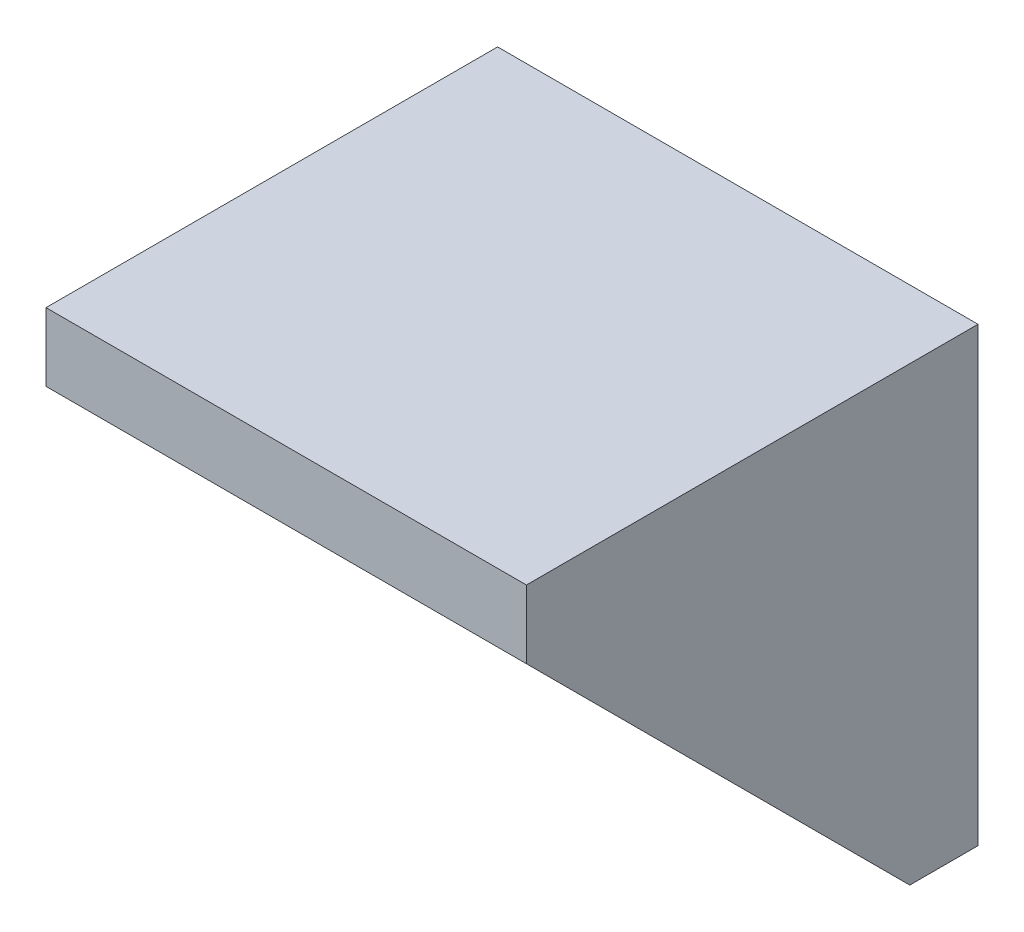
ISO-10303-21;
HEADER;
FILE_DESCRIPTION(('STEP AP214'),'2;1');
FILE_NAME('part.step','',(''),(''),'','','');
FILE_SCHEMA(('AUTOMOTIVE_DESIGN { 1 0 10303 214 1 1 1 1 }'));
ENDSEC;
DATA;
#1=APPLICATION_CONTEXT('core data for automotive mechanical design processes');
#2=APPLICATION_PROTOCOL_DEFINITION('international standard','automotive_design',2000,#1);
#3=PRODUCT_CONTEXT('',#1,'mechanical');
#4=PRODUCT('Part','Part','',(#3));
#5=PRODUCT_RELATED_PRODUCT_CATEGORY('part','',(#4));
#6=PRODUCT_DEFINITION_FORMATION('','',#4);
#7=PRODUCT_DEFINITION_CONTEXT('part definition',#1,'design');
#8=PRODUCT_DEFINITION('design','',#6,#7);
#9=PRODUCT_DEFINITION_SHAPE('','',#8);
#10=(LENGTH_UNIT() NAMED_UNIT(*) SI_UNIT(.MILLI.,.METRE.));
#11=(NAMED_UNIT(*) PLANE_ANGLE_UNIT() SI_UNIT($,.RADIAN.));
#12=(NAMED_UNIT(*) SI_UNIT($,.STERADIAN.) SOLID_ANGLE_UNIT());
#13=UNCERTAINTY_MEASURE_WITH_UNIT(LENGTH_MEASURE(1.E-05),#10,'distance_accuracy_value','');
#14=(GEOMETRIC_REPRESENTATION_CONTEXT(3) GLOBAL_UNCERTAINTY_ASSIGNED_CONTEXT((#13)) GLOBAL_UNIT_ASSIGNED_CONTEXT((#10,
#11,#12)) REPRESENTATION_CONTEXT('',''));
#15=CARTESIAN_POINT('',(0.,0.,0.));
#16=DIRECTION('',(0.,0.,1.));
#17=DIRECTION('',(1.,0.,0.));
#18=AXIS2_PLACEMENT_3D('',#15,#16,#17);
#19=CARTESIAN_POINT('',(38.1,-35.814,5.4102));
#20=DIRECTION('',(0.,0.707106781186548,-0.707106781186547));
#21=DIRECTION('',(0.,0.707106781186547,0.707106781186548));
#22=AXIS2_PLACEMENT_3D('',#19,#20,#21);
#23=PLANE('',#22);
#24=DIRECTION('',(-1.,0.,0.));
#25=VECTOR('',#24,1.);
#26=CARTESIAN_POINT('',(38.1,-35.814,5.4102));
#27=LINE('',#26,#25);
#28=CARTESIAN_POINT('',(3.04800000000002,-35.814,5.4102));
#29=VERTEX_POINT('',#28);
#30=CARTESIAN_POINT('',(0.,-35.814,5.4102));
#31=VERTEX_POINT('',#30);
#32=EDGE_CURVE('E115',#29,#31,#27,.T.);
#33=ORIENTED_EDGE('',*,*,#32,.F.);
#34=DIRECTION('',(0.,0.707106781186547,0.707106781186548));
#35=VECTOR('',#34,1.);
#36=CARTESIAN_POINT('',(3.048,-35.814,5.41019999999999));
#37=LINE('',#36,#35);
#38=CARTESIAN_POINT('',(3.048,-5.4102,35.814));
#39=VERTEX_POINT('',#38);
#40=EDGE_CURVE('E11',#29,#39,#37,.T.);
#41=ORIENTED_EDGE('',*,*,#40,.T.);
#42=DIRECTION('',(-1.,0.,0.));
#43=VECTOR('',#42,1.);
#44=CARTESIAN_POINT('',(38.1,-5.4102,35.814));
#45=LINE('',#44,#43);
#46=CARTESIAN_POINT('',(0.,-5.4102,35.814));
#47=VERTEX_POINT('',#46);
#48=EDGE_CURVE('E114',#39,#47,#45,.T.);
#49=ORIENTED_EDGE('',*,*,#48,.T.);
#50=DIRECTION('',(0.,-0.707106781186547,-0.707106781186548));
#51=VECTOR('',#50,1.);
#52=CARTESIAN_POINT('',(0.,-35.814,5.4102));
#53=LINE('',#52,#51);
#54=EDGE_CURVE('E131',#47,#31,#53,.T.);
#55=ORIENTED_EDGE('',*,*,#54,.T.);
#56=EDGE_LOOP('',(#33,#41,#49,#55));
#57=FACE_BOUND('',#56,.T.);
#58=ADVANCED_FACE('F33',(#57),#23,.F.);
#59=CARTESIAN_POINT('',(38.1,0.,35.814));
#60=DIRECTION('',(0.,-1.,0.));
#61=DIRECTION('',(0.,0.,-1.));
#62=AXIS2_PLACEMENT_3D('',#59,#60,#61);
#63=PLANE('',#62);
#64=DIRECTION('',(0.,0.,1.));
#65=VECTOR('',#64,1.);
#66=CARTESIAN_POINT('',(0.,0.,35.814));
#67=LINE('',#66,#65);
#68=CARTESIAN_POINT('',(0.,0.,0.));
#69=VERTEX_POINT('',#68);
#70=CARTESIAN_POINT('',(0.,0.,35.814));
#71=VERTEX_POINT('',#70);
#72=EDGE_CURVE('E124',#69,#71,#67,.T.);
#73=ORIENTED_EDGE('',*,*,#72,.T.);
#74=DIRECTION('',(-1.,0.,0.));
#75=VECTOR('',#74,1.);
#76=CARTESIAN_POINT('',(38.1,0.,35.814));
#77=LINE('',#76,#75);
#78=CARTESIAN_POINT('',(38.1,0.,35.814));
#79=VERTEX_POINT('',#78);
#80=EDGE_CURVE('E142',#79,#71,#77,.T.);
#81=ORIENTED_EDGE('',*,*,#80,.F.);
#82=DIRECTION('',(0.,0.,1.));
#83=VECTOR('',#82,1.);
#84=CARTESIAN_POINT('',(38.1,0.,35.814));
#85=LINE('',#84,#83);
#86=CARTESIAN_POINT('',(38.1,0.,0.));
#87=VERTEX_POINT('',#86);
#88=EDGE_CURVE('E137',#87,#79,#85,.T.);
#89=ORIENTED_EDGE('',*,*,#88,.F.);
#90=DIRECTION('',(-1.,0.,0.));
#91=VECTOR('',#90,1.);
#92=CARTESIAN_POINT('',(38.1,0.,0.));
#93=LINE('',#92,#91);
#94=EDGE_CURVE('E120',#87,#69,#93,.T.);
#95=ORIENTED_EDGE('',*,*,#94,.T.);
#96=EDGE_LOOP('',(#73,#81,#89,#95));
#97=FACE_BOUND('',#96,.T.);
#98=ADVANCED_FACE('F35',(#97),#63,.F.);
#99=CARTESIAN_POINT('',(38.1,-5.4102,35.814));
#100=DIRECTION('',(0.,0.,-1.));
#101=DIRECTION('',(-1.,0.,0.));
#102=AXIS2_PLACEMENT_3D('',#99,#100,#101);
#103=PLANE('',#102);
#104=DIRECTION('',(0.,-1.,0.));
#105=VECTOR('',#104,1.);
#106=CARTESIAN_POINT('',(0.,-5.4102,35.814));
#107=LINE('',#106,#105);
#108=EDGE_CURVE('E127',#71,#47,#107,.T.);
#109=ORIENTED_EDGE('',*,*,#108,.T.);
#110=ORIENTED_EDGE('',*,*,#48,.F.);
#111=DIRECTION('',(-1.,0.,0.));
#112=VECTOR('',#111,1.);
#113=CARTESIAN_POINT('',(3.048,-5.4102,35.814));
#114=LINE('',#113,#112);
#115=CARTESIAN_POINT('',(35.052,-5.4102,35.814));
#116=VERTEX_POINT('',#115);
#117=EDGE_CURVE('E158',#116,#39,#114,.T.);
#118=ORIENTED_EDGE('',*,*,#117,.F.);
#119=CARTESIAN_POINT('',(38.1,-5.4102,35.814));
#120=VERTEX_POINT('',#119);
#121=EDGE_CURVE('E140',#120,#116,#45,.T.);
#122=ORIENTED_EDGE('',*,*,#121,.F.);
#123=DIRECTION('',(0.,-1.,0.));
#124=VECTOR('',#123,1.);
#125=CARTESIAN_POINT('',(38.1,-5.4102,35.814));
#126=LINE('',#125,#124);
#127=EDGE_CURVE('E90',#79,#120,#126,.T.);
#128=ORIENTED_EDGE('',*,*,#127,.F.);
#129=ORIENTED_EDGE('',*,*,#80,.T.);
#130=EDGE_LOOP('',(#109,#110,#118,#122,#128,#129));
#131=FACE_BOUND('',#130,.T.);
#132=ADVANCED_FACE('F144',(#131),#103,.F.);
#133=ORIENTED_EDGE('',*,*,#121,.T.);
#134=DIRECTION('',(0.,-0.707106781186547,-0.707106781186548));
#135=VECTOR('',#134,1.);
#136=CARTESIAN_POINT('',(35.052,-35.814,5.4102));
#137=LINE('',#136,#135);
#138=CARTESIAN_POINT('',(35.052,-35.814,5.4102));
#139=VERTEX_POINT('',#138);
#140=EDGE_CURVE('E41',#116,#139,#137,.T.);
#141=ORIENTED_EDGE('',*,*,#140,.T.);
#142=CARTESIAN_POINT('',(38.1,-35.814,5.4102));
#143=VERTEX_POINT('',#142);
#144=EDGE_CURVE('E108',#143,#139,#27,.T.);
#145=ORIENTED_EDGE('',*,*,#144,.F.);
#146=DIRECTION('',(0.,-0.707106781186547,-0.707106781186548));
#147=VECTOR('',#146,1.);
#148=CARTESIAN_POINT('',(38.1,-35.814,5.4102));
#149=LINE('',#148,#147);
#150=EDGE_CURVE('E97',#120,#143,#149,.T.);
#151=ORIENTED_EDGE('',*,*,#150,.F.);
#152=EDGE_LOOP('',(#133,#141,#145,#151));
#153=FACE_BOUND('',#152,.T.);
#154=ADVANCED_FACE('F109',(#153),#23,.F.);
#155=CARTESIAN_POINT('',(38.1,-35.814,0.));
#156=DIRECTION('',(0.,1.,0.));
#157=DIRECTION('',(0.,0.,1.));
#158=AXIS2_PLACEMENT_3D('',#155,#156,#157);
#159=PLANE('',#158);
#160=DIRECTION('',(0.,0.,-1.));
#161=VECTOR('',#160,1.);
#162=CARTESIAN_POINT('',(0.,-35.814,0.));
#163=LINE('',#162,#161);
#164=CARTESIAN_POINT('',(0.,-35.814,0.));
#165=VERTEX_POINT('',#164);
#166=EDGE_CURVE('E134',#31,#165,#163,.T.);
#167=ORIENTED_EDGE('',*,*,#166,.T.);
#168=DIRECTION('',(-1.,0.,0.));
#169=VECTOR('',#168,1.);
#170=CARTESIAN_POINT('',(38.1,-35.814,0.));
#171=LINE('',#170,#169);
#172=CARTESIAN_POINT('',(38.1,-35.814,0.));
#173=VERTEX_POINT('',#172);
#174=EDGE_CURVE('E118',#173,#165,#171,.T.);
#175=ORIENTED_EDGE('',*,*,#174,.F.);
#176=DIRECTION('',(0.,0.,-1.));
#177=VECTOR('',#176,1.);
#178=CARTESIAN_POINT('',(38.1,-35.814,0.));
#179=LINE('',#178,#177);
#180=EDGE_CURVE('E101',#143,#173,#179,.T.);
#181=ORIENTED_EDGE('',*,*,#180,.F.);
#182=ORIENTED_EDGE('',*,*,#144,.T.);
#183=DIRECTION('',(1.,0.,0.));
#184=VECTOR('',#183,1.);
#185=CARTESIAN_POINT('',(3.048,-35.814,5.4102));
#186=LINE('',#185,#184);
#187=EDGE_CURVE('E179',#29,#139,#186,.T.);
#188=ORIENTED_EDGE('',*,*,#187,.F.);
#189=ORIENTED_EDGE('',*,*,#32,.T.);
#190=EDGE_LOOP('',(#167,#175,#181,#182,#188,#189));
#191=FACE_BOUND('',#190,.T.);
#192=ADVANCED_FACE('F117',(#191),#159,.F.);
#193=CARTESIAN_POINT('',(38.1,0.,0.));
#194=DIRECTION('',(0.,0.,1.));
#195=DIRECTION('',(0.,-1.,0.));
#196=AXIS2_PLACEMENT_3D('',#193,#194,#195);
#197=PLANE('',#196);
#198=DIRECTION('',(0.,1.,0.));
#199=VECTOR('',#198,1.);
#200=CARTESIAN_POINT('',(0.,0.,0.));
#201=LINE('',#200,#199);
#202=EDGE_CURVE('E81',#165,#69,#201,.T.);
#203=ORIENTED_EDGE('',*,*,#202,.T.);
#204=ORIENTED_EDGE('',*,*,#94,.F.);
#205=DIRECTION('',(0.,1.,0.));
#206=VECTOR('',#205,1.);
#207=CARTESIAN_POINT('',(38.1,0.,0.));
#208=LINE('',#207,#206);
#209=EDGE_CURVE('E57',#173,#87,#208,.T.);
#210=ORIENTED_EDGE('',*,*,#209,.F.);
#211=ORIENTED_EDGE('',*,*,#174,.T.);
#212=EDGE_LOOP('',(#203,#204,#210,#211));
#213=FACE_BOUND('',#212,.T.);
#214=ADVANCED_FACE('F209',(#213),#197,.F.);
#215=CARTESIAN_POINT('',(38.1,0.,0.));
#216=DIRECTION('',(-1.,0.,0.));
#217=DIRECTION('',(0.,0.,1.));
#218=AXIS2_PLACEMENT_3D('',#215,#216,#217);
#219=PLANE('',#218);
#220=ORIENTED_EDGE('',*,*,#88,.T.);
#221=ORIENTED_EDGE('',*,*,#127,.T.);
#222=ORIENTED_EDGE('',*,*,#150,.T.);
#223=ORIENTED_EDGE('',*,*,#180,.T.);
#224=ORIENTED_EDGE('',*,*,#209,.T.);
#225=EDGE_LOOP('',(#220,#221,#222,#223,#224));
#226=FACE_BOUND('',#225,.T.);
#227=ADVANCED_FACE('F99',(#226),#219,.F.);
#228=CARTESIAN_POINT('',(0.,0.,0.));
#229=DIRECTION('',(-1.,0.,0.));
#230=DIRECTION('',(0.,0.,1.));
#231=AXIS2_PLACEMENT_3D('',#228,#229,#230);
#232=PLANE('',#231);
#233=ORIENTED_EDGE('',*,*,#72,.F.);
#234=ORIENTED_EDGE('',*,*,#202,.F.);
#235=ORIENTED_EDGE('',*,*,#166,.F.);
#236=ORIENTED_EDGE('',*,*,#54,.F.);
#237=ORIENTED_EDGE('',*,*,#108,.F.);
#238=EDGE_LOOP('',(#233,#234,#235,#236,#237));
#239=FACE_BOUND('',#238,.T.);
#240=ADVANCED_FACE('F151',(#239),#232,.T.);
#241=CARTESIAN_POINT('',(3.048,-5.4102,5.4102));
#242=DIRECTION('',(-1.,0.,0.));
#243=DIRECTION('',(0.,-1.,0.));
#244=AXIS2_PLACEMENT_3D('',#241,#242,#243);
#245=PLANE('',#244);
#246=DIRECTION('',(0.,-1.,0.));
#247=VECTOR('',#246,1.);
#248=CARTESIAN_POINT('',(3.048,-5.4102,5.4102));
#249=LINE('',#248,#247);
#250=CARTESIAN_POINT('',(3.048,-5.4102,5.4102));
#251=VERTEX_POINT('',#250);
#252=EDGE_CURVE('E48',#251,#29,#249,.T.);
#253=ORIENTED_EDGE('',*,*,#252,.F.);
#254=DIRECTION('',(0.,0.,1.));
#255=VECTOR('',#254,1.);
#256=CARTESIAN_POINT('',(3.048,-5.4102,5.4102));
#257=LINE('',#256,#255);
#258=EDGE_CURVE('E128',#251,#39,#257,.T.);
#259=ORIENTED_EDGE('',*,*,#258,.T.);
#260=ORIENTED_EDGE('',*,*,#40,.F.);
#261=EDGE_LOOP('',(#253,#259,#260));
#262=FACE_BOUND('',#261,.T.);
#263=ADVANCED_FACE('F188',(#262),#245,.F.);
#264=CARTESIAN_POINT('',(35.052,-5.4102,5.4102));
#265=DIRECTION('',(1.,0.,0.));
#266=DIRECTION('',(0.,1.,0.));
#267=AXIS2_PLACEMENT_3D('',#264,#265,#266);
#268=PLANE('',#267);
#269=DIRECTION('',(0.,0.,1.));
#270=VECTOR('',#269,1.);
#271=CARTESIAN_POINT('',(35.052,-5.4102,5.4102));
#272=LINE('',#271,#270);
#273=CARTESIAN_POINT('',(35.052,-5.4102,5.4102));
#274=VERTEX_POINT('',#273);
#275=EDGE_CURVE('E170',#274,#116,#272,.T.);
#276=ORIENTED_EDGE('',*,*,#275,.F.);
#277=DIRECTION('',(0.,1.,0.));
#278=VECTOR('',#277,1.);
#279=CARTESIAN_POINT('',(35.052,-5.4102,5.4102));
#280=LINE('',#279,#278);
#281=EDGE_CURVE('E173',#139,#274,#280,.T.);
#282=ORIENTED_EDGE('',*,*,#281,.F.);
#283=ORIENTED_EDGE('',*,*,#140,.F.);
#284=EDGE_LOOP('',(#276,#282,#283));
#285=FACE_BOUND('',#284,.T.);
#286=ADVANCED_FACE('F172',(#285),#268,.F.);
#287=CARTESIAN_POINT('',(3.048,-5.4102,5.4102));
#288=DIRECTION('',(0.,1.,0.));
#289=DIRECTION('',(0.,0.,1.));
#290=AXIS2_PLACEMENT_3D('',#287,#288,#289);
#291=PLANE('',#290);
#292=ORIENTED_EDGE('',*,*,#117,.T.);
#293=ORIENTED_EDGE('',*,*,#258,.F.);
#294=DIRECTION('',(-1.,0.,0.));
#295=VECTOR('',#294,1.);
#296=CARTESIAN_POINT('',(3.048,-5.4102,5.4102));
#297=LINE('',#296,#295);
#298=EDGE_CURVE('E176',#274,#251,#297,.T.);
#299=ORIENTED_EDGE('',*,*,#298,.F.);
#300=ORIENTED_EDGE('',*,*,#275,.T.);
#301=EDGE_LOOP('',(#292,#293,#299,#300));
#302=FACE_BOUND('',#301,.T.);
#303=ADVANCED_FACE('F181',(#302),#291,.F.);
#304=CARTESIAN_POINT('',(0.,0.,5.4102));
#305=DIRECTION('',(0.,0.,1.));
#306=DIRECTION('',(1.,0.,0.));
#307=AXIS2_PLACEMENT_3D('',#304,#305,#306);
#308=PLANE('',#307);
#309=ORIENTED_EDGE('',*,*,#252,.T.);
#310=ORIENTED_EDGE('',*,*,#187,.T.);
#311=ORIENTED_EDGE('',*,*,#281,.T.);
#312=ORIENTED_EDGE('',*,*,#298,.T.);
#313=EDGE_LOOP('',(#309,#310,#311,#312));
#314=FACE_BOUND('',#313,.T.);
#315=ADVANCED_FACE('F178',(#314),#308,.T.);
#316=CLOSED_SHELL('',(#58,#98,#132,#154,#192,#214,#227,#240,#263,#286,#303,#315));
#317=MANIFOLD_SOLID_BREP('B2',#316);
#318=ADVANCED_BREP_SHAPE_REPRESENTATION('',(#18,#317),#14);
#319=SHAPE_DEFINITION_REPRESENTATION(#9,#318);
ENDSEC;
END-ISO-10303-21;
